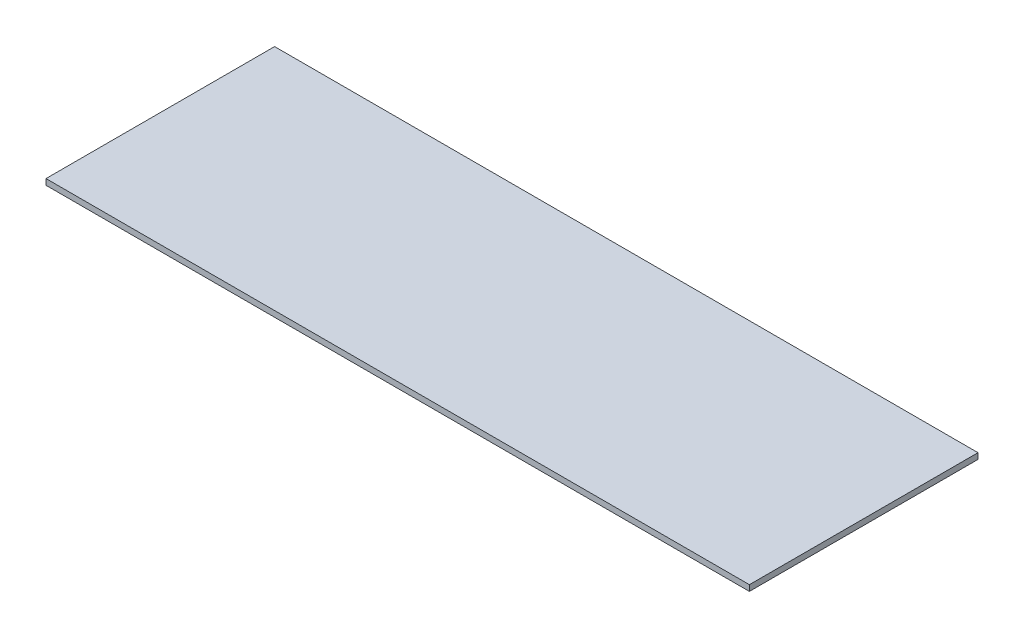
ISO-10303-21;
HEADER;
FILE_DESCRIPTION(('STEP AP214'),'2;1');
FILE_NAME('part.step','',(''),(''),'','','');
FILE_SCHEMA(('AUTOMOTIVE_DESIGN { 1 0 10303 214 1 1 1 1 }'));
ENDSEC;
DATA;
#1=APPLICATION_CONTEXT('core data for automotive mechanical design processes');
#2=APPLICATION_PROTOCOL_DEFINITION('international standard','automotive_design',2000,#1);
#3=PRODUCT_CONTEXT('',#1,'mechanical');
#4=PRODUCT('Part','Part','',(#3));
#5=PRODUCT_RELATED_PRODUCT_CATEGORY('part','',(#4));
#6=PRODUCT_DEFINITION_FORMATION('','',#4);
#7=PRODUCT_DEFINITION_CONTEXT('part definition',#1,'design');
#8=PRODUCT_DEFINITION('design','',#6,#7);
#9=PRODUCT_DEFINITION_SHAPE('','',#8);
#10=(LENGTH_UNIT() NAMED_UNIT(*) SI_UNIT(.MILLI.,.METRE.));
#11=(NAMED_UNIT(*) PLANE_ANGLE_UNIT() SI_UNIT($,.RADIAN.));
#12=(NAMED_UNIT(*) SI_UNIT($,.STERADIAN.) SOLID_ANGLE_UNIT());
#13=UNCERTAINTY_MEASURE_WITH_UNIT(LENGTH_MEASURE(1.E-05),#10,'distance_accuracy_value','');
#14=(GEOMETRIC_REPRESENTATION_CONTEXT(3) GLOBAL_UNCERTAINTY_ASSIGNED_CONTEXT((#13)) GLOBAL_UNIT_ASSIGNED_CONTEXT((#10,
#11,#12)) REPRESENTATION_CONTEXT('',''));
#15=CARTESIAN_POINT('',(0.,0.,0.));
#16=DIRECTION('',(0.,0.,1.));
#17=DIRECTION('',(1.,0.,0.));
#18=AXIS2_PLACEMENT_3D('',#15,#16,#17);
#19=CARTESIAN_POINT('',(381.,6.35,123.825));
#20=DIRECTION('',(-1.,0.,0.));
#21=DIRECTION('',(0.,0.,1.));
#22=AXIS2_PLACEMENT_3D('',#19,#20,#21);
#23=PLANE('',#22);
#24=DIRECTION('',(0.,0.,-1.));
#25=VECTOR('',#24,1.);
#26=CARTESIAN_POINT('',(381.,0.,123.825));
#27=LINE('',#26,#25);
#28=CARTESIAN_POINT('',(381.,0.,123.825));
#29=VERTEX_POINT('',#28);
#30=CARTESIAN_POINT('',(381.,0.,-123.825));
#31=VERTEX_POINT('',#30);
#32=EDGE_CURVE('E103',#29,#31,#27,.T.);
#33=ORIENTED_EDGE('',*,*,#32,.T.);
#34=DIRECTION('',(0.,-1.,0.));
#35=VECTOR('',#34,1.);
#36=CARTESIAN_POINT('',(381.,6.35,-123.825));
#37=LINE('',#36,#35);
#38=CARTESIAN_POINT('',(381.,6.35,-123.825));
#39=VERTEX_POINT('',#38);
#40=EDGE_CURVE('E11',#39,#31,#37,.T.);
#41=ORIENTED_EDGE('',*,*,#40,.F.);
#42=DIRECTION('',(0.,0.,-1.));
#43=VECTOR('',#42,1.);
#44=CARTESIAN_POINT('',(381.,6.35,123.825));
#45=LINE('',#44,#43);
#46=CARTESIAN_POINT('',(381.,6.35,123.825));
#47=VERTEX_POINT('',#46);
#48=EDGE_CURVE('E91',#47,#39,#45,.T.);
#49=ORIENTED_EDGE('',*,*,#48,.F.);
#50=DIRECTION('',(0.,-1.,0.));
#51=VECTOR('',#50,1.);
#52=CARTESIAN_POINT('',(381.,6.35,123.825));
#53=LINE('',#52,#51);
#54=EDGE_CURVE('E99',#47,#29,#53,.T.);
#55=ORIENTED_EDGE('',*,*,#54,.T.);
#56=EDGE_LOOP('',(#33,#41,#49,#55));
#57=FACE_BOUND('',#56,.T.);
#58=ADVANCED_FACE('F40',(#57),#23,.F.);
#59=CARTESIAN_POINT('',(-381.,6.35,-123.825));
#60=DIRECTION('',(0.,0.,1.));
#61=DIRECTION('',(1.,0.,0.));
#62=AXIS2_PLACEMENT_3D('',#59,#60,#61);
#63=PLANE('',#62);
#64=DIRECTION('',(-1.,0.,0.));
#65=VECTOR('',#64,1.);
#66=CARTESIAN_POINT('',(-381.,0.,-123.825));
#67=LINE('',#66,#65);
#68=CARTESIAN_POINT('',(-381.,0.,-123.825));
#69=VERTEX_POINT('',#68);
#70=EDGE_CURVE('E95',#31,#69,#67,.T.);
#71=ORIENTED_EDGE('',*,*,#70,.T.);
#72=DIRECTION('',(0.,-1.,0.));
#73=VECTOR('',#72,1.);
#74=CARTESIAN_POINT('',(-381.,6.35,-123.825));
#75=LINE('',#74,#73);
#76=CARTESIAN_POINT('',(-381.,6.35,-123.825));
#77=VERTEX_POINT('',#76);
#78=EDGE_CURVE('E48',#77,#69,#75,.T.);
#79=ORIENTED_EDGE('',*,*,#78,.F.);
#80=DIRECTION('',(-1.,0.,0.));
#81=VECTOR('',#80,1.);
#82=CARTESIAN_POINT('',(-381.,6.35,-123.825));
#83=LINE('',#82,#81);
#84=EDGE_CURVE('E86',#39,#77,#83,.T.);
#85=ORIENTED_EDGE('',*,*,#84,.F.);
#86=ORIENTED_EDGE('',*,*,#40,.T.);
#87=EDGE_LOOP('',(#71,#79,#85,#86));
#88=FACE_BOUND('',#87,.T.);
#89=ADVANCED_FACE('F94',(#88),#63,.F.);
#90=CARTESIAN_POINT('',(-381.,6.35,123.825));
#91=DIRECTION('',(1.,0.,0.));
#92=DIRECTION('',(0.,0.,-1.));
#93=AXIS2_PLACEMENT_3D('',#90,#91,#92);
#94=PLANE('',#93);
#95=DIRECTION('',(0.,0.,1.));
#96=VECTOR('',#95,1.);
#97=CARTESIAN_POINT('',(-381.,0.,123.825));
#98=LINE('',#97,#96);
#99=CARTESIAN_POINT('',(-381.,0.,123.825));
#100=VERTEX_POINT('',#99);
#101=EDGE_CURVE('E73',#69,#100,#98,.T.);
#102=ORIENTED_EDGE('',*,*,#101,.T.);
#103=DIRECTION('',(0.,-1.,0.));
#104=VECTOR('',#103,1.);
#105=CARTESIAN_POINT('',(-381.,6.35,123.825));
#106=LINE('',#105,#104);
#107=CARTESIAN_POINT('',(-381.,6.35,123.825));
#108=VERTEX_POINT('',#107);
#109=EDGE_CURVE('E96',#108,#100,#106,.T.);
#110=ORIENTED_EDGE('',*,*,#109,.F.);
#111=DIRECTION('',(0.,0.,1.));
#112=VECTOR('',#111,1.);
#113=CARTESIAN_POINT('',(-381.,6.35,123.825));
#114=LINE('',#113,#112);
#115=EDGE_CURVE('E89',#77,#108,#114,.T.);
#116=ORIENTED_EDGE('',*,*,#115,.F.);
#117=ORIENTED_EDGE('',*,*,#78,.T.);
#118=EDGE_LOOP('',(#102,#110,#116,#117));
#119=FACE_BOUND('',#118,.T.);
#120=ADVANCED_FACE('F97',(#119),#94,.F.);
#121=CARTESIAN_POINT('',(-381.,6.35,123.825));
#122=DIRECTION('',(0.,0.,-1.));
#123=DIRECTION('',(-1.,0.,0.));
#124=AXIS2_PLACEMENT_3D('',#121,#122,#123);
#125=PLANE('',#124);
#126=DIRECTION('',(1.,0.,0.));
#127=VECTOR('',#126,1.);
#128=CARTESIAN_POINT('',(-381.,0.,123.825));
#129=LINE('',#128,#127);
#130=EDGE_CURVE('E79',#100,#29,#129,.T.);
#131=ORIENTED_EDGE('',*,*,#130,.T.);
#132=ORIENTED_EDGE('',*,*,#54,.F.);
#133=DIRECTION('',(1.,0.,0.));
#134=VECTOR('',#133,1.);
#135=CARTESIAN_POINT('',(-381.,6.35,123.825));
#136=LINE('',#135,#134);
#137=EDGE_CURVE('E56',#108,#47,#136,.T.);
#138=ORIENTED_EDGE('',*,*,#137,.F.);
#139=ORIENTED_EDGE('',*,*,#109,.T.);
#140=EDGE_LOOP('',(#131,#132,#138,#139));
#141=FACE_BOUND('',#140,.T.);
#142=ADVANCED_FACE('F110',(#141),#125,.F.);
#143=CARTESIAN_POINT('',(0.,6.35,0.));
#144=DIRECTION('',(0.,-1.,0.));
#145=DIRECTION('',(0.,0.,-1.));
#146=AXIS2_PLACEMENT_3D('',#143,#144,#145);
#147=PLANE('',#146);
#148=ORIENTED_EDGE('',*,*,#48,.T.);
#149=ORIENTED_EDGE('',*,*,#84,.T.);
#150=ORIENTED_EDGE('',*,*,#115,.T.);
#151=ORIENTED_EDGE('',*,*,#137,.T.);
#152=EDGE_LOOP('',(#148,#149,#150,#151));
#153=FACE_BOUND('',#152,.T.);
#154=ADVANCED_FACE('F87',(#153),#147,.F.);
#155=CARTESIAN_POINT('',(0.,0.,0.));
#156=DIRECTION('',(0.,-1.,0.));
#157=DIRECTION('',(0.,0.,-1.));
#158=AXIS2_PLACEMENT_3D('',#155,#156,#157);
#159=PLANE('',#158);
#160=ORIENTED_EDGE('',*,*,#32,.F.);
#161=ORIENTED_EDGE('',*,*,#130,.F.);
#162=ORIENTED_EDGE('',*,*,#101,.F.);
#163=ORIENTED_EDGE('',*,*,#70,.F.);
#164=EDGE_LOOP('',(#160,#161,#162,#163));
#165=FACE_BOUND('',#164,.T.);
#166=ADVANCED_FACE('F113',(#165),#159,.T.);
#167=CLOSED_SHELL('',(#58,#89,#120,#142,#154,#166));
#168=MANIFOLD_SOLID_BREP('B2',#167);
#169=ADVANCED_BREP_SHAPE_REPRESENTATION('',(#18,#168),#14);
#170=SHAPE_DEFINITION_REPRESENTATION(#9,#169);
ENDSEC;
END-ISO-10303-21;
